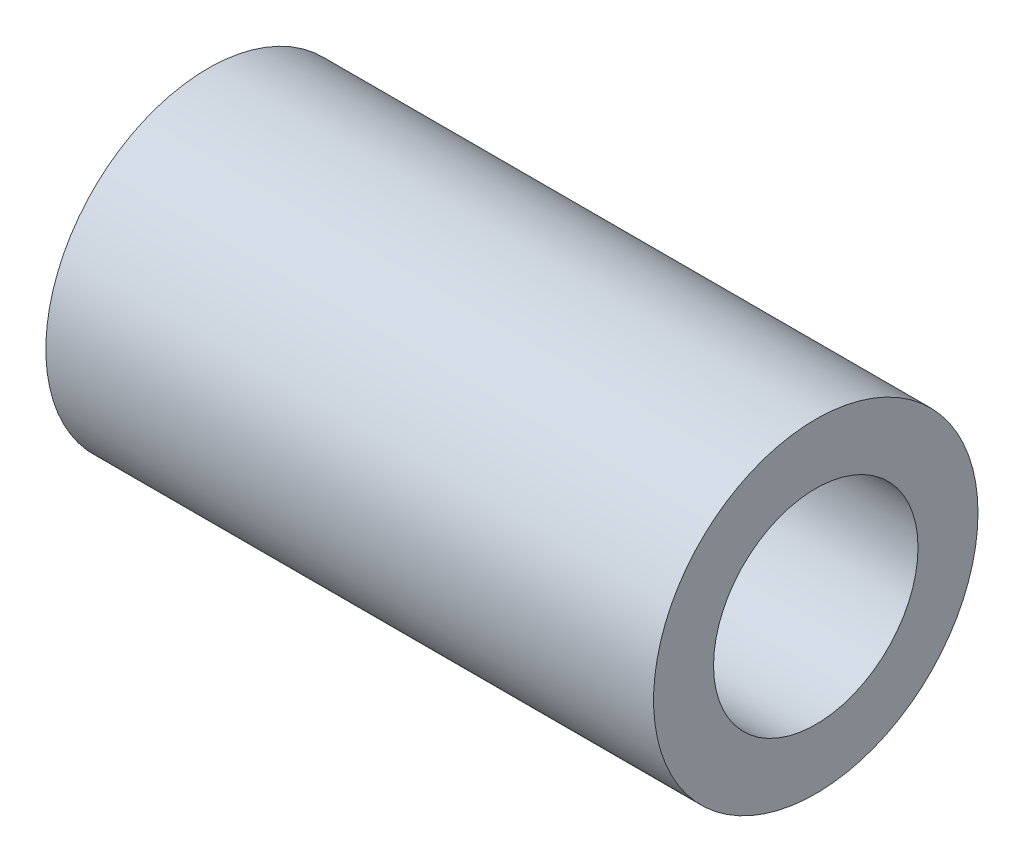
from build123d import *

# Parameters (mm, degrees)
SKETCH1_R      = 15.113
SKETCH1_R_2    = 9.525
EXTRUDE1_DEPTH = 28.3083


with BuildPart() as part:
    # Sketch1 → Extrude1 (new, symmetric)
    with BuildSketch(Plane(origin=(0, 0, 0), x_dir=(0, 0, -1), z_dir=(1, 0, 0))):
        Circle(SKETCH1_R)
        Circle(SKETCH1_R_2, mode=Mode.SUBTRACT)
    extrude(amount=EXTRUDE1_DEPTH, both=True)


solid = part.part
